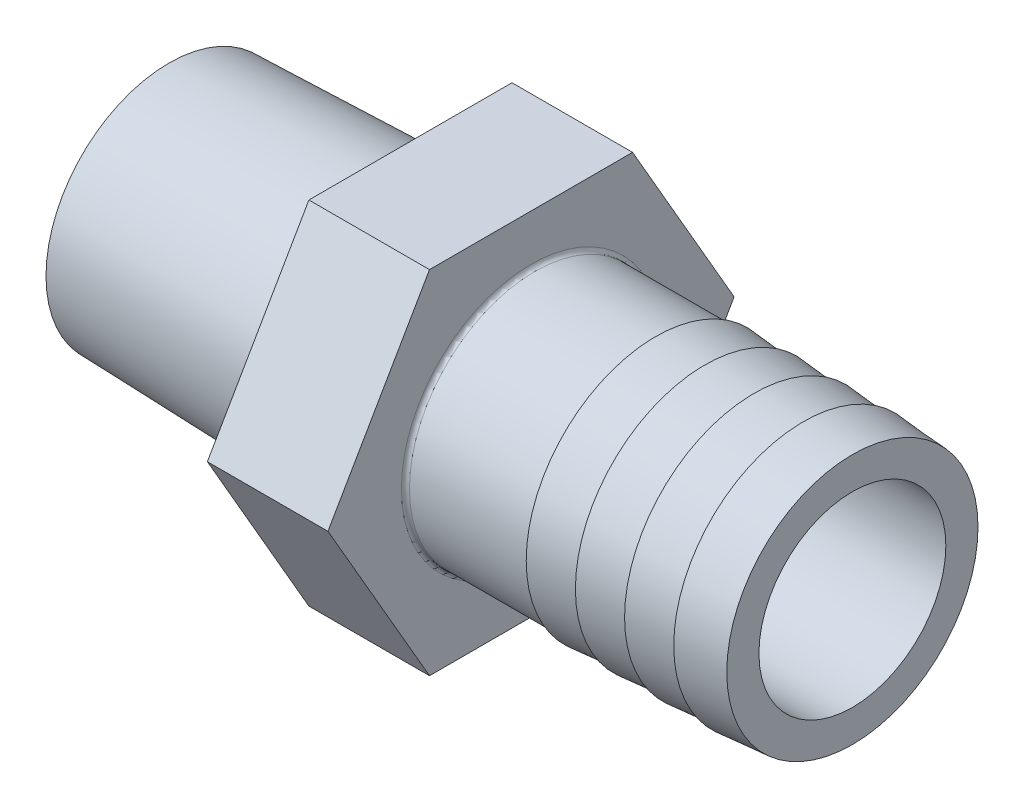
from build123d import *

# Parameters (mm, degrees)
NUT_START = -7.62
NUT_DEPTH = 7.62


with BuildPart() as part:
    # Sketch1 → Base-Revolve (revolve)
    with BuildSketch(Plane.XY, mode=Mode.PRIVATE) as base_revolve_sk:
        with BuildLine():
            Line((-15.25524, 7.772527), (0, 8.249306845))
            Line((0, 8.249306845), (7.62, 8.249306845))
            Line((7.62, 8.249306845), (7.62, 8.1915))
            ThreePointArc((7.62, 8.1915), (7.694394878, 8.011894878), (7.874, 7.9375))
            Line((7.874, 7.9375), (15.494, 7.9375))
            Line((15.494, 7.9375), (15.494, 8.1788))
            Line((15.494, 8.1788), (18.60169, 7.9375))
            Line((18.60169, 7.9375), (18.60169, 8.1788))
            Line((18.60169, 8.1788), (21.70938, 7.9375))
            Line((21.70938, 7.9375), (21.70938, 8.1788))
            Line((21.70938, 8.1788), (24.81707, 7.9375))
            Line((24.81707, 7.9375), (24.81707, 8.1788))
            Line((24.81707, 8.1788), (27.92476, 7.9375))
            Line((27.92476, 7.9375), (27.92476, 5.9055))
            Line((27.92476, 5.9055), (-15.25524, 5.9055))
            Line((-15.25524, 5.9055), (-15.25524, 7.772527))
        make_face()
    revolve(base_revolve_sk.sketch.rotate(Axis((-50.8, 0, 0), (1, 0, 0)), 90), axis=Axis((-50.8, 0, 0), (1, 0, 0)))

    # Sketch2 → nut (add)
    with BuildSketch(Plane(origin=(7.62, 0, 0), x_dir=(0, 0, -1), z_dir=(1, 0, 0)).offset(NUT_START)):
        Polygon((12.831609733, 0), (6.415804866, 11.1125), (-6.415804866, 11.1125), (-12.831609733, 0), (-6.415804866, -11.1125), (6.415804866, -11.1125), align=None)
    extrude(amount=NUT_DEPTH)


solid = part.part
